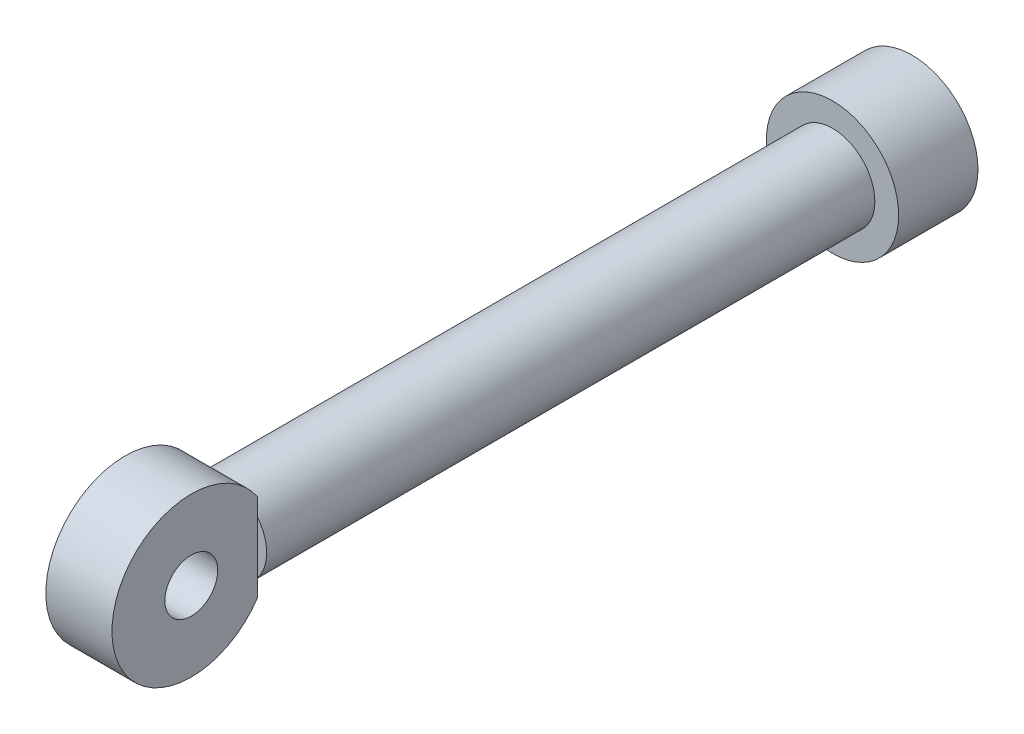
from build123d import *

# Parameters (mm, degrees)
SKETCH_1_R      = 25
EXTRUDE_1_DEPTH = 30
SKETCH_2_R      = 16
EXTRUDE_2_DEPTH = 230
SKETCH_3_R      = 10
EXTRUDE_3_DEPTH = 12.5


with BuildPart() as part:
    # Sketch 1 → Extrude 1 (new body)
    with BuildSketch(Plane.XY):
        Circle(SKETCH_1_R)
    extrude(amount=EXTRUDE_1_DEPTH)

    # Sketch 2 → Extrude 2 (add)
    with BuildSketch(Plane.XY.offset(30)):
        Circle(SKETCH_2_R)
    extrude(amount=EXTRUDE_2_DEPTH)

    # Sketch 3 → Extrude 3 (add, symmetric)
    with BuildSketch(Plane(origin=(0, 0, 0), x_dir=(0, 0, -1), z_dir=(1, 0, 0))):
        with BuildLine():
            Line((-260, 16.583123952), (-260, -16.583123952))
            ThreePointArc((-260, -16.583123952), (-315, 0), (-260, 16.583123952))
        make_face()
        with Locations((-285, 0)):
            Circle(SKETCH_3_R, mode=Mode.SUBTRACT)
    extrude(amount=EXTRUDE_3_DEPTH, both=True)


solid = part.part
